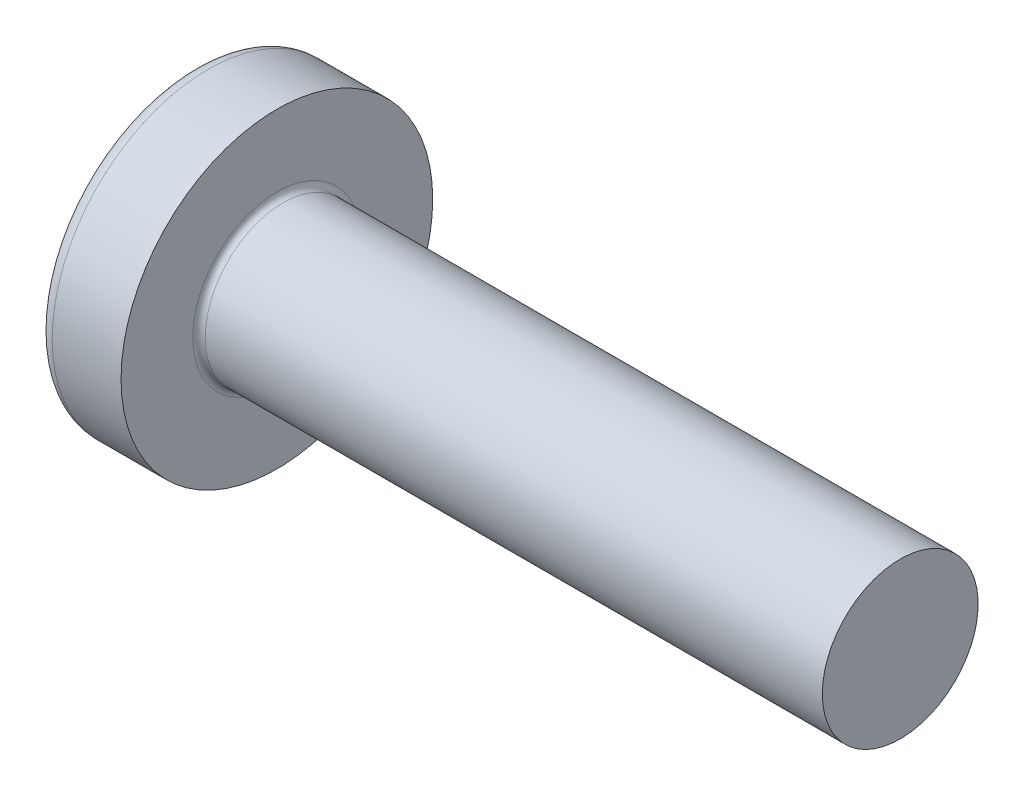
ISO-10303-21;
HEADER;
FILE_DESCRIPTION(('STEP AP214'),'2;1');
FILE_NAME('part.step','',(''),(''),'','','');
FILE_SCHEMA(('AUTOMOTIVE_DESIGN { 1 0 10303 214 1 1 1 1 }'));
ENDSEC;
DATA;
#1=APPLICATION_CONTEXT('core data for automotive mechanical design processes');
#2=APPLICATION_PROTOCOL_DEFINITION('international standard','automotive_design',2000,#1);
#3=PRODUCT_CONTEXT('',#1,'mechanical');
#4=PRODUCT('Part','Part','',(#3));
#5=PRODUCT_RELATED_PRODUCT_CATEGORY('part','',(#4));
#6=PRODUCT_DEFINITION_FORMATION('','',#4);
#7=PRODUCT_DEFINITION_CONTEXT('part definition',#1,'design');
#8=PRODUCT_DEFINITION('design','',#6,#7);
#9=PRODUCT_DEFINITION_SHAPE('','',#8);
#10=(LENGTH_UNIT() NAMED_UNIT(*) SI_UNIT(.MILLI.,.METRE.));
#11=(NAMED_UNIT(*) PLANE_ANGLE_UNIT() SI_UNIT($,.RADIAN.));
#12=(NAMED_UNIT(*) SI_UNIT($,.STERADIAN.) SOLID_ANGLE_UNIT());
#13=UNCERTAINTY_MEASURE_WITH_UNIT(LENGTH_MEASURE(1.E-05),#10,'distance_accuracy_value','');
#14=(GEOMETRIC_REPRESENTATION_CONTEXT(3) GLOBAL_UNCERTAINTY_ASSIGNED_CONTEXT((#13)) GLOBAL_UNIT_ASSIGNED_CONTEXT((#10,
#11,#12)) REPRESENTATION_CONTEXT('',''));
#15=CARTESIAN_POINT('',(0.,0.,0.));
#16=DIRECTION('',(0.,0.,1.));
#17=DIRECTION('',(1.,0.,0.));
#18=AXIS2_PLACEMENT_3D('',#15,#16,#17);
#19=CARTESIAN_POINT('',(4.,0.,0.));
#20=DIRECTION('',(-1.,0.,0.));
#21=DIRECTION('',(0.,1.,0.));
#22=AXIS2_PLACEMENT_3D('',#19,#20,#21);
#23=SPHERICAL_SURFACE('',#22,4.);
#24=CARTESIAN_POINT('',(0.803195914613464,0.,0.));
#25=DIRECTION('',(-1.,0.,0.));
#26=DIRECTION('',(0.,0.,1.));
#27=AXIS2_PLACEMENT_3D('',#24,#25,#26);
#28=CIRCLE('',#27,2.40425531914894);
#29=CARTESIAN_POINT('',(0.803195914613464,0.,2.40425531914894));
#30=VERTEX_POINT('',#29);
#31=EDGE_CURVE('E237',#30,#30,#28,.T.);
#32=ORIENTED_EDGE('',*,*,#31,.T.);
#33=EDGE_LOOP('',(#32));
#34=FACE_BOUND('',#33,.T.);
#35=CARTESIAN_POINT('',(0.0543400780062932,0.,0.));
#36=DIRECTION('',(1.,0.,0.));
#37=DIRECTION('',(0.,0.,-1.));
#38=AXIS2_PLACEMENT_3D('',#35,#36,#37);
#39=CIRCLE('',#38,0.657090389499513);
#40=CARTESIAN_POINT('',(0.0543400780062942,-0.369999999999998,-0.54301729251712));
#41=VERTEX_POINT('',#40);
#42=CARTESIAN_POINT('',(0.0543400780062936,-0.543017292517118,-0.37));
#43=VERTEX_POINT('',#42);
#44=EDGE_CURVE('E373',#41,#43,#39,.F.);
#45=ORIENTED_EDGE('',*,*,#44,.F.);
#46=CARTESIAN_POINT('',(4.,-0.37,0.));
#47=DIRECTION('',(0.,1.,0.));
#48=DIRECTION('',(0.,0.,1.));
#49=AXIS2_PLACEMENT_3D('',#46,#47,#48);
#50=CIRCLE('',#49,3.98285073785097);
#51=CARTESIAN_POINT('',(0.201999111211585,-0.369999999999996,-1.19928697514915));
#52=VERTEX_POINT('',#51);
#53=EDGE_CURVE('E299',#52,#41,#50,.T.);
#54=ORIENTED_EDGE('',*,*,#53,.F.);
#55=CARTESIAN_POINT('',(3.72274328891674,0.,0.556091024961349));
#56=DIRECTION('',(0.446197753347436,0.,-0.894934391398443));
#57=DIRECTION('',(-0.894934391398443,0.,-0.446197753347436));
#58=AXIS2_PLACEMENT_3D('',#55,#56,#57);
#59=CIRCLE('',#58,3.95144169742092);
#60=CARTESIAN_POINT('',(0.201999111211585,0.370000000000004,-1.19928697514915));
#61=VERTEX_POINT('',#60);
#62=EDGE_CURVE('E271',#52,#61,#59,.T.);
#63=ORIENTED_EDGE('',*,*,#62,.T.);
#64=CARTESIAN_POINT('',(4.,0.37,0.));
#65=DIRECTION('',(0.,-1.,0.));
#66=DIRECTION('',(0.,0.,-1.));
#67=AXIS2_PLACEMENT_3D('',#64,#65,#66);
#68=CIRCLE('',#67,3.98285073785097);
#69=CARTESIAN_POINT('',(0.0543400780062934,0.370000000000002,-0.543017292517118));
#70=VERTEX_POINT('',#69);
#71=EDGE_CURVE('E326',#70,#61,#68,.T.);
#72=ORIENTED_EDGE('',*,*,#71,.F.);
#73=CARTESIAN_POINT('',(0.0543400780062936,0.543017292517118,-0.37));
#74=VERTEX_POINT('',#73);
#75=EDGE_CURVE('E392',#74,#70,#39,.F.);
#76=ORIENTED_EDGE('',*,*,#75,.F.);
#77=CARTESIAN_POINT('',(4.,0.,-0.37));
#78=DIRECTION('',(0.,0.,1.));
#79=DIRECTION('',(1.,0.,0.));
#80=AXIS2_PLACEMENT_3D('',#77,#78,#79);
#81=CIRCLE('',#80,3.98285073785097);
#82=CARTESIAN_POINT('',(0.201999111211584,1.19928697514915,-0.37));
#83=VERTEX_POINT('',#82);
#84=EDGE_CURVE('E265',#83,#74,#81,.T.);
#85=ORIENTED_EDGE('',*,*,#84,.F.);
#86=CARTESIAN_POINT('',(3.72274328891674,-0.556091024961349,0.));
#87=DIRECTION('',(0.446197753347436,0.894934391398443,0.));
#88=DIRECTION('',(-0.894934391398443,0.446197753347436,0.));
#89=AXIS2_PLACEMENT_3D('',#86,#87,#88);
#90=CIRCLE('',#89,3.95144169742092);
#91=CARTESIAN_POINT('',(0.201999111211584,1.19928697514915,0.37));
#92=VERTEX_POINT('',#91);
#93=EDGE_CURVE('E268',#83,#92,#90,.T.);
#94=ORIENTED_EDGE('',*,*,#93,.T.);
#95=CARTESIAN_POINT('',(4.,0.,0.37));
#96=DIRECTION('',(0.,0.,-1.));
#97=DIRECTION('',(0.,1.,0.));
#98=AXIS2_PLACEMENT_3D('',#95,#96,#97);
#99=CIRCLE('',#98,3.98285073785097);
#100=CARTESIAN_POINT('',(0.0543400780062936,0.543017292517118,0.37));
#101=VERTEX_POINT('',#100);
#102=EDGE_CURVE('E261',#101,#92,#99,.T.);
#103=ORIENTED_EDGE('',*,*,#102,.F.);
#104=CARTESIAN_POINT('',(0.0543400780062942,0.369999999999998,0.54301729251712));
#105=VERTEX_POINT('',#104);
#106=EDGE_CURVE('E391',#105,#101,#39,.F.);
#107=ORIENTED_EDGE('',*,*,#106,.F.);
#108=CARTESIAN_POINT('',(0.201999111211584,0.369999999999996,1.19928697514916));
#109=VERTEX_POINT('',#108);
#110=EDGE_CURVE('E281',#109,#105,#68,.T.);
#111=ORIENTED_EDGE('',*,*,#110,.F.);
#112=CARTESIAN_POINT('',(3.72274328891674,0.,-0.556091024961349));
#113=DIRECTION('',(0.446197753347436,0.,0.894934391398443));
#114=DIRECTION('',(0.894934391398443,0.,-0.446197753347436));
#115=AXIS2_PLACEMENT_3D('',#112,#113,#114);
#116=CIRCLE('',#115,3.95144169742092);
#117=CARTESIAN_POINT('',(0.201999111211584,-0.370000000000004,1.19928697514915));
#118=VERTEX_POINT('',#117);
#119=EDGE_CURVE('E48',#109,#118,#116,.T.);
#120=ORIENTED_EDGE('',*,*,#119,.T.);
#121=CARTESIAN_POINT('',(0.0543400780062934,-0.370000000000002,0.543017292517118));
#122=VERTEX_POINT('',#121);
#123=EDGE_CURVE('E278',#122,#118,#50,.T.);
#124=ORIENTED_EDGE('',*,*,#123,.F.);
#125=CARTESIAN_POINT('',(0.0543400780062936,-0.543017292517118,0.37));
#126=VERTEX_POINT('',#125);
#127=EDGE_CURVE('E431',#126,#122,#39,.F.);
#128=ORIENTED_EDGE('',*,*,#127,.F.);
#129=CARTESIAN_POINT('',(0.201999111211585,-1.19928697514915,0.37));
#130=VERTEX_POINT('',#129);
#131=EDGE_CURVE('E262',#130,#126,#99,.T.);
#132=ORIENTED_EDGE('',*,*,#131,.F.);
#133=CARTESIAN_POINT('',(3.72274328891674,0.556091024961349,0.));
#134=DIRECTION('',(0.446197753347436,-0.894934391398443,0.));
#135=DIRECTION('',(0.894934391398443,0.446197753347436,0.));
#136=AXIS2_PLACEMENT_3D('',#133,#134,#135);
#137=CIRCLE('',#136,3.95144169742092);
#138=CARTESIAN_POINT('',(0.201999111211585,-1.19928697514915,-0.37));
#139=VERTEX_POINT('',#138);
#140=EDGE_CURVE('E258',#130,#139,#137,.T.);
#141=ORIENTED_EDGE('',*,*,#140,.T.);
#142=EDGE_CURVE('E63',#43,#139,#81,.T.);
#143=ORIENTED_EDGE('',*,*,#142,.F.);
#144=EDGE_LOOP('',(#45,#54,#63,#72,#76,#85,#94,#103,#107,#111,#120,#124,#128,#132,#141,#143));
#145=FACE_BOUND('',#144,.T.);
#146=ADVANCED_FACE('F34',(#34,#145),#23,.T.);
#147=CARTESIAN_POINT('',(1.5,0.552127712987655,-0.37));
#148=DIRECTION('',(0.,0.,1.));
#149=DIRECTION('',(1.,0.,0.));
#150=AXIS2_PLACEMENT_3D('',#147,#148,#149);
#151=PLANE('',#150);
#152=ORIENTED_EDGE('',*,*,#84,.T.);
#153=CARTESIAN_POINT('',(-0.98410748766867,0.628943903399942,-0.37));
#154=CARTESIAN_POINT('',(-0.783603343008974,0.612669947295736,-0.37));
#155=CARTESIAN_POINT('',(-0.583110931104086,0.596248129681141,-0.37));
#156=CARTESIAN_POINT('',(-0.182155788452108,0.562989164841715,-0.37));
#157=CARTESIAN_POINT('',(0.0183069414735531,0.546152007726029,-0.37));
#158=CARTESIAN_POINT('',(0.419186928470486,0.511943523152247,-0.37));
#159=CARTESIAN_POINT('',(0.61960418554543,0.4945721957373,-0.37));
#160=CARTESIAN_POINT('',(1.02037173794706,0.459102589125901,-0.37));
#161=CARTESIAN_POINT('',(1.22072203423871,0.441004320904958,-0.37));
#162=CARTESIAN_POINT('',(1.53631168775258,0.411665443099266,-0.37));
#163=CARTESIAN_POINT('',(1.65158348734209,0.400774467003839,-0.37));
#164=CARTESIAN_POINT('',(1.88208360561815,0.378547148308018,-0.37));
#165=CARTESIAN_POINT('',(1.99731192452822,0.367210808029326,-0.37));
#166=CARTESIAN_POINT('',(2.22771614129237,0.343963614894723,-0.37));
#167=CARTESIAN_POINT('',(2.34289203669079,0.332052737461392,-0.37));
#168=CARTESIAN_POINT('',(2.5731581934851,0.30741320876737,-0.37));
#169=CARTESIAN_POINT('',(2.68824845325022,0.294684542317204,-0.37));
#170=CARTESIAN_POINT('',(2.80327961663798,0.281425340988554,-0.37));
#171=B_SPLINE_CURVE_WITH_KNOTS('',3,(#153,#154,#155,#156,#157,#158,#159,#160,#161,#162,#163,
#164,#165,#166,#167,#168,#169,#170),.UNSPECIFIED.,.F.,.F.,(4,2,2,2,2,2,2,2,4),(0.,
0.603490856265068,1.20699609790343,1.81050129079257,2.41399737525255,2.7613521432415,
3.1087051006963,3.45607293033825,3.80344721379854),.UNSPECIFIED.);
#172=CARTESIAN_POINT('',(1.5,0.415013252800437,-0.370000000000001));
#173=VERTEX_POINT('',#172);
#174=EDGE_CURVE('E415',#74,#173,#171,.T.);
#175=ORIENTED_EDGE('',*,*,#174,.T.);
#176=DIRECTION('',(0.,1.,0.));
#177=VECTOR('',#176,1.);
#178=CARTESIAN_POINT('',(1.5,-0.552127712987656,-0.37));
#179=LINE('',#178,#177);
#180=CARTESIAN_POINT('',(1.5,0.552127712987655,-0.37));
#181=VERTEX_POINT('',#180);
#182=EDGE_CURVE('E355',#173,#181,#179,.T.);
#183=ORIENTED_EDGE('',*,*,#182,.T.);
#184=DIRECTION('',(0.894934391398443,-0.446197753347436,0.));
#185=VECTOR('',#184,1.);
#186=CARTESIAN_POINT('',(0.,1.3,-0.37));
#187=LINE('',#186,#185);
#188=EDGE_CURVE('E238',#83,#181,#187,.T.);
#189=ORIENTED_EDGE('',*,*,#188,.F.);
#190=EDGE_LOOP('',(#152,#175,#183,#189));
#191=FACE_BOUND('',#190,.T.);
#192=ADVANCED_FACE('F193',(#191),#151,.T.);
#193=CARTESIAN_POINT('',(1.5,-0.552127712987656,-0.37));
#194=VERTEX_POINT('',#193);
#195=CARTESIAN_POINT('',(1.5,-0.415013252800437,-0.370000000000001));
#196=VERTEX_POINT('',#195);
#197=EDGE_CURVE('E246',#194,#196,#179,.T.);
#198=ORIENTED_EDGE('',*,*,#197,.T.);
#199=CARTESIAN_POINT('',(-0.98410748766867,-0.628943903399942,-0.37));
#200=CARTESIAN_POINT('',(-0.783603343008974,-0.612669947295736,-0.37));
#201=CARTESIAN_POINT('',(-0.583110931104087,-0.596248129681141,-0.37));
#202=CARTESIAN_POINT('',(-0.182155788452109,-0.562989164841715,-0.37));
#203=CARTESIAN_POINT('',(0.0183069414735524,-0.546152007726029,-0.37));
#204=CARTESIAN_POINT('',(0.419186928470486,-0.511943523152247,-0.37));
#205=CARTESIAN_POINT('',(0.619604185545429,-0.4945721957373,-0.37));
#206=CARTESIAN_POINT('',(1.02037173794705,-0.4591025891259,-0.37));
#207=CARTESIAN_POINT('',(1.22072203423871,-0.441004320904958,-0.37));
#208=CARTESIAN_POINT('',(1.53631168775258,-0.411665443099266,-0.37));
#209=CARTESIAN_POINT('',(1.65158348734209,-0.400774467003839,-0.37));
#210=CARTESIAN_POINT('',(1.88208360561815,-0.378547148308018,-0.37));
#211=CARTESIAN_POINT('',(1.99731192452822,-0.367210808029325,-0.37));
#212=CARTESIAN_POINT('',(2.22771614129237,-0.343963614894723,-0.37));
#213=CARTESIAN_POINT('',(2.34289203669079,-0.332052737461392,-0.37));
#214=CARTESIAN_POINT('',(2.5731581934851,-0.30741320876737,-0.37));
#215=CARTESIAN_POINT('',(2.68824845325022,-0.294684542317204,-0.37));
#216=CARTESIAN_POINT('',(2.80327961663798,-0.281425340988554,-0.37));
#217=B_SPLINE_CURVE_WITH_KNOTS('',3,(#199,#200,#201,#202,#203,#204,#205,#206,#207,#208,#209,
#210,#211,#212,#213,#214,#215,#216),.UNSPECIFIED.,.F.,.F.,(4,2,2,2,2,2,2,2,4),(0.,
0.603490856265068,1.20699609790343,1.81050129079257,2.41399737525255,2.7613521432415,
3.1087051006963,3.45607293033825,3.80344721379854),.UNSPECIFIED.);
#218=EDGE_CURVE('E390',#196,#43,#217,.F.);
#219=ORIENTED_EDGE('',*,*,#218,.T.);
#220=ORIENTED_EDGE('',*,*,#142,.T.);
#221=DIRECTION('',(0.894934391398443,0.446197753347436,0.));
#222=VECTOR('',#221,1.);
#223=CARTESIAN_POINT('',(0.,-1.3,-0.37));
#224=LINE('',#223,#222);
#225=EDGE_CURVE('E329',#139,#194,#224,.T.);
#226=ORIENTED_EDGE('',*,*,#225,.T.);
#227=EDGE_LOOP('',(#198,#219,#220,#226));
#228=FACE_BOUND('',#227,.T.);
#229=ADVANCED_FACE('F199',(#228),#151,.T.);
#230=CARTESIAN_POINT('',(1.5,-0.552127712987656,0.37));
#231=DIRECTION('',(0.,0.,-1.));
#232=DIRECTION('',(0.,1.,0.));
#233=AXIS2_PLACEMENT_3D('',#230,#231,#232);
#234=PLANE('',#233);
#235=DIRECTION('',(0.,-1.,0.));
#236=VECTOR('',#235,1.);
#237=CARTESIAN_POINT('',(1.5,0.552127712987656,0.37));
#238=LINE('',#237,#236);
#239=CARTESIAN_POINT('',(1.5,0.552127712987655,0.37));
#240=VERTEX_POINT('',#239);
#241=CARTESIAN_POINT('',(1.5,0.415013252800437,0.370000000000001));
#242=VERTEX_POINT('',#241);
#243=EDGE_CURVE('E338',#240,#242,#238,.T.);
#244=ORIENTED_EDGE('',*,*,#243,.T.);
#245=CARTESIAN_POINT('',(-0.98410748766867,0.628943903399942,0.37));
#246=CARTESIAN_POINT('',(-0.783603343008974,0.612669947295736,0.37));
#247=CARTESIAN_POINT('',(-0.583110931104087,0.596248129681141,0.37));
#248=CARTESIAN_POINT('',(-0.182155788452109,0.562989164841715,0.37));
#249=CARTESIAN_POINT('',(0.0183069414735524,0.546152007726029,0.37));
#250=CARTESIAN_POINT('',(0.419186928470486,0.511943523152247,0.37));
#251=CARTESIAN_POINT('',(0.619604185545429,0.4945721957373,0.37));
#252=CARTESIAN_POINT('',(1.02037173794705,0.459102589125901,0.37));
#253=CARTESIAN_POINT('',(1.22072203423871,0.441004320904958,0.37));
#254=CARTESIAN_POINT('',(1.53631168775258,0.411665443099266,0.37));
#255=CARTESIAN_POINT('',(1.65158348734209,0.400774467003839,0.37));
#256=CARTESIAN_POINT('',(1.88208360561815,0.378547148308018,0.37));
#257=CARTESIAN_POINT('',(1.99731192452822,0.367210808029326,0.37));
#258=CARTESIAN_POINT('',(2.22771614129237,0.343963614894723,0.37));
#259=CARTESIAN_POINT('',(2.34289203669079,0.332052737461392,0.37));
#260=CARTESIAN_POINT('',(2.5731581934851,0.30741320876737,0.37));
#261=CARTESIAN_POINT('',(2.68824845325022,0.294684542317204,0.37));
#262=CARTESIAN_POINT('',(2.80327961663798,0.281425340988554,0.37));
#263=B_SPLINE_CURVE_WITH_KNOTS('',3,(#245,#246,#247,#248,#249,#250,#251,#252,#253,#254,#255,
#256,#257,#258,#259,#260,#261,#262),.UNSPECIFIED.,.F.,.F.,(4,2,2,2,2,2,2,2,4),(0.,
0.603490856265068,1.20699609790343,1.81050129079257,2.41399737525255,2.7613521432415,
3.1087051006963,3.45607293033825,3.80344721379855),.UNSPECIFIED.);
#264=EDGE_CURVE('E670',#242,#101,#263,.F.);
#265=ORIENTED_EDGE('',*,*,#264,.T.);
#266=ORIENTED_EDGE('',*,*,#102,.T.);
#267=DIRECTION('',(0.894934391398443,-0.446197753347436,0.));
#268=VECTOR('',#267,1.);
#269=CARTESIAN_POINT('',(0.,1.3,0.37));
#270=LINE('',#269,#268);
#271=EDGE_CURVE('E243',#92,#240,#270,.T.);
#272=ORIENTED_EDGE('',*,*,#271,.T.);
#273=EDGE_LOOP('',(#244,#265,#266,#272));
#274=FACE_BOUND('',#273,.T.);
#275=ADVANCED_FACE('F411',(#274),#234,.T.);
#276=ORIENTED_EDGE('',*,*,#131,.T.);
#277=CARTESIAN_POINT('',(-0.98410748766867,-0.628943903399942,0.37));
#278=CARTESIAN_POINT('',(-0.783603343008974,-0.612669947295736,0.37));
#279=CARTESIAN_POINT('',(-0.583110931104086,-0.596248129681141,0.37));
#280=CARTESIAN_POINT('',(-0.182155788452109,-0.562989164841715,0.37));
#281=CARTESIAN_POINT('',(0.0183069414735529,-0.546152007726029,0.37));
#282=CARTESIAN_POINT('',(0.419186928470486,-0.511943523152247,0.37));
#283=CARTESIAN_POINT('',(0.61960418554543,-0.4945721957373,0.37));
#284=CARTESIAN_POINT('',(1.02037173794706,-0.459102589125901,0.37));
#285=CARTESIAN_POINT('',(1.22072203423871,-0.441004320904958,0.37));
#286=CARTESIAN_POINT('',(1.53631168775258,-0.411665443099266,0.37));
#287=CARTESIAN_POINT('',(1.65158348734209,-0.400774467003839,0.37));
#288=CARTESIAN_POINT('',(1.88208360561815,-0.378547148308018,0.37));
#289=CARTESIAN_POINT('',(1.99731192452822,-0.367210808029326,0.37));
#290=CARTESIAN_POINT('',(2.22771614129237,-0.343963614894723,0.37));
#291=CARTESIAN_POINT('',(2.34289203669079,-0.332052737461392,0.37));
#292=CARTESIAN_POINT('',(2.5731581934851,-0.307413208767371,0.37));
#293=CARTESIAN_POINT('',(2.68824845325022,-0.294684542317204,0.37));
#294=CARTESIAN_POINT('',(2.80327961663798,-0.281425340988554,0.37));
#295=B_SPLINE_CURVE_WITH_KNOTS('',3,(#277,#278,#279,#280,#281,#282,#283,#284,#285,#286,#287,
#288,#289,#290,#291,#292,#293,#294),.UNSPECIFIED.,.F.,.F.,(4,2,2,2,2,2,2,2,4),(0.,
0.603490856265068,1.20699609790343,1.81050129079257,2.41399737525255,2.7613521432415,
3.1087051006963,3.45607293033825,3.80344721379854),.UNSPECIFIED.);
#296=CARTESIAN_POINT('',(1.5,-0.415013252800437,0.370000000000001));
#297=VERTEX_POINT('',#296);
#298=EDGE_CURVE('E432',#126,#297,#295,.T.);
#299=ORIENTED_EDGE('',*,*,#298,.T.);
#300=CARTESIAN_POINT('',(1.5,-0.552127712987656,0.37));
#301=VERTEX_POINT('',#300);
#302=EDGE_CURVE('E340',#297,#301,#238,.T.);
#303=ORIENTED_EDGE('',*,*,#302,.T.);
#304=DIRECTION('',(0.894934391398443,0.446197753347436,0.));
#305=VECTOR('',#304,1.);
#306=CARTESIAN_POINT('',(0.,-1.3,0.37));
#307=LINE('',#306,#305);
#308=EDGE_CURVE('E331',#130,#301,#307,.T.);
#309=ORIENTED_EDGE('',*,*,#308,.F.);
#310=EDGE_LOOP('',(#276,#299,#303,#309));
#311=FACE_BOUND('',#310,.T.);
#312=ADVANCED_FACE('F518',(#311),#234,.T.);
#313=CARTESIAN_POINT('',(1.5,0.552127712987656,0.37));
#314=DIRECTION('',(0.446197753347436,0.894934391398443,0.));
#315=DIRECTION('',(-0.894934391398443,0.446197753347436,0.));
#316=AXIS2_PLACEMENT_3D('',#313,#314,#315);
#317=PLANE('',#316);
#318=CARTESIAN_POINT('',(2.47007552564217,0.0684659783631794,0.));
#319=DIRECTION('',(0.446197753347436,0.894934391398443,0.));
#320=DIRECTION('',(-0.894934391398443,0.446197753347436,0.));
#321=AXIS2_PLACEMENT_3D('',#318,#319,#320);
#322=ELLIPSE('',#321,1.0940568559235,0.483340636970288);
#323=CARTESIAN_POINT('',(1.5,0.552127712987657,0.0655056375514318));
#324=VERTEX_POINT('',#323);
#325=CARTESIAN_POINT('',(1.5,0.552127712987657,-0.0655056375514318));
#326=VERTEX_POINT('',#325);
#327=EDGE_CURVE('E304',#324,#326,#322,.F.);
#328=ORIENTED_EDGE('',*,*,#327,.F.);
#329=DIRECTION('',(0.,0.,-1.));
#330=VECTOR('',#329,1.);
#331=CARTESIAN_POINT('',(1.5,0.552127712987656,0.37));
#332=LINE('',#331,#330);
#333=EDGE_CURVE('E341',#240,#324,#332,.T.);
#334=ORIENTED_EDGE('',*,*,#333,.F.);
#335=ORIENTED_EDGE('',*,*,#271,.F.);
#336=ORIENTED_EDGE('',*,*,#93,.F.);
#337=ORIENTED_EDGE('',*,*,#188,.T.);
#338=EDGE_CURVE('E343',#326,#181,#332,.T.);
#339=ORIENTED_EDGE('',*,*,#338,.F.);
#340=EDGE_LOOP('',(#328,#334,#335,#336,#337,#339));
#341=FACE_BOUND('',#340,.T.);
#342=ADVANCED_FACE('F409',(#341),#317,.F.);
#343=CARTESIAN_POINT('',(0.,-1.3,-0.37));
#344=DIRECTION('',(0.446197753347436,-0.894934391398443,0.));
#345=DIRECTION('',(0.894934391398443,0.446197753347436,0.));
#346=AXIS2_PLACEMENT_3D('',#343,#344,#345);
#347=PLANE('',#346);
#348=CARTESIAN_POINT('',(2.47007552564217,-0.0684659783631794,0.));
#349=DIRECTION('',(0.446197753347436,-0.894934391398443,0.));
#350=DIRECTION('',(-0.894934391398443,-0.446197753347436,0.));
#351=AXIS2_PLACEMENT_3D('',#348,#349,#350);
#352=ELLIPSE('',#351,1.0940568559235,0.483340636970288);
#353=CARTESIAN_POINT('',(1.5,-0.552127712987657,-0.0655056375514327));
#354=VERTEX_POINT('',#353);
#355=CARTESIAN_POINT('',(1.5,-0.552127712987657,0.0655056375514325));
#356=VERTEX_POINT('',#355);
#357=EDGE_CURVE('E672',#354,#356,#352,.F.);
#358=ORIENTED_EDGE('',*,*,#357,.F.);
#359=DIRECTION('',(0.,0.,1.));
#360=VECTOR('',#359,1.);
#361=CARTESIAN_POINT('',(1.5,-0.552127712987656,-0.37));
#362=LINE('',#361,#360);
#363=EDGE_CURVE('E334',#194,#354,#362,.T.);
#364=ORIENTED_EDGE('',*,*,#363,.F.);
#365=ORIENTED_EDGE('',*,*,#225,.F.);
#366=ORIENTED_EDGE('',*,*,#140,.F.);
#367=ORIENTED_EDGE('',*,*,#308,.T.);
#368=EDGE_CURVE('E337',#356,#301,#362,.T.);
#369=ORIENTED_EDGE('',*,*,#368,.F.);
#370=EDGE_LOOP('',(#358,#364,#365,#366,#367,#369));
#371=FACE_BOUND('',#370,.T.);
#372=ADVANCED_FACE('F505',(#371),#347,.F.);
#373=CARTESIAN_POINT('',(1.5,0.552127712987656,-0.37));
#374=DIRECTION('',(-1.,0.,0.));
#375=DIRECTION('',(0.,0.,1.));
#376=AXIS2_PLACEMENT_3D('',#373,#374,#375);
#377=PLANE('',#376);
#378=DIRECTION('',(0.,1.,0.));
#379=VECTOR('',#378,1.);
#380=CARTESIAN_POINT('',(1.5,-0.370000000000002,0.552127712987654));
#381=LINE('',#380,#379);
#382=CARTESIAN_POINT('',(1.5,-0.370000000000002,0.552127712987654));
#383=VERTEX_POINT('',#382);
#384=CARTESIAN_POINT('',(1.5,-0.0655056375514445,0.552127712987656));
#385=VERTEX_POINT('',#384);
#386=EDGE_CURVE('E319',#383,#385,#381,.T.);
#387=ORIENTED_EDGE('',*,*,#386,.T.);
#388=CARTESIAN_POINT('',(1.5,0.,0.));
#389=DIRECTION('',(-1.,0.,0.));
#390=DIRECTION('',(0.,0.,1.));
#391=AXIS2_PLACEMENT_3D('',#388,#389,#390);
#392=CIRCLE('',#391,0.556);
#393=CARTESIAN_POINT('',(1.5,-0.370000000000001,0.415013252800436));
#394=VERTEX_POINT('',#393);
#395=EDGE_CURVE('E700',#394,#385,#392,.T.);
#396=ORIENTED_EDGE('',*,*,#395,.F.);
#397=DIRECTION('',(0.,0.,-1.));
#398=VECTOR('',#397,1.);
#399=CARTESIAN_POINT('',(1.5,-0.370000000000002,0.552127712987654));
#400=LINE('',#399,#398);
#401=EDGE_CURVE('E315',#383,#394,#400,.T.);
#402=ORIENTED_EDGE('',*,*,#401,.F.);
#403=EDGE_LOOP('',(#387,#396,#402));
#404=FACE_BOUND('',#403,.T.);
#405=ADVANCED_FACE('F498',(#404),#377,.T.);
#406=ORIENTED_EDGE('',*,*,#302,.F.);
#407=EDGE_CURVE('E705',#356,#297,#392,.T.);
#408=ORIENTED_EDGE('',*,*,#407,.F.);
#409=ORIENTED_EDGE('',*,*,#368,.T.);
#410=EDGE_LOOP('',(#406,#408,#409));
#411=FACE_BOUND('',#410,.T.);
#412=ADVANCED_FACE('F491',(#411),#377,.T.);
#413=ORIENTED_EDGE('',*,*,#363,.T.);
#414=EDGE_CURVE('E384',#196,#354,#392,.T.);
#415=ORIENTED_EDGE('',*,*,#414,.F.);
#416=ORIENTED_EDGE('',*,*,#197,.F.);
#417=EDGE_LOOP('',(#413,#415,#416));
#418=FACE_BOUND('',#417,.T.);
#419=ADVANCED_FACE('F485',(#418),#377,.T.);
#420=CARTESIAN_POINT('',(1.5,-0.369999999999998,-0.415013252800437));
#421=VERTEX_POINT('',#420);
#422=CARTESIAN_POINT('',(1.5,-0.369999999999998,-0.552127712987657));
#423=VERTEX_POINT('',#422);
#424=EDGE_CURVE('E318',#421,#423,#400,.T.);
#425=ORIENTED_EDGE('',*,*,#424,.F.);
#426=CARTESIAN_POINT('',(1.5,-0.0655056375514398,-0.552127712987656));
#427=VERTEX_POINT('',#426);
#428=EDGE_CURVE('E55',#427,#421,#392,.T.);
#429=ORIENTED_EDGE('',*,*,#428,.F.);
#430=DIRECTION('',(0.,-1.,0.));
#431=VECTOR('',#430,1.);
#432=CARTESIAN_POINT('',(1.5,0.370000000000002,-0.552127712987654));
#433=LINE('',#432,#431);
#434=EDGE_CURVE('E314',#427,#423,#433,.T.);
#435=ORIENTED_EDGE('',*,*,#434,.T.);
#436=EDGE_LOOP('',(#425,#429,#435));
#437=FACE_BOUND('',#436,.T.);
#438=ADVANCED_FACE('F379',(#437),#377,.T.);
#439=CARTESIAN_POINT('',(1.5,0.370000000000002,-0.552127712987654));
#440=VERTEX_POINT('',#439);
#441=CARTESIAN_POINT('',(1.5,0.0655056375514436,-0.552127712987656));
#442=VERTEX_POINT('',#441);
#443=EDGE_CURVE('E311',#440,#442,#433,.T.);
#444=ORIENTED_EDGE('',*,*,#443,.T.);
#445=CARTESIAN_POINT('',(1.5,0.370000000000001,-0.415013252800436));
#446=VERTEX_POINT('',#445);
#447=EDGE_CURVE('E383',#446,#442,#392,.T.);
#448=ORIENTED_EDGE('',*,*,#447,.F.);
#449=DIRECTION('',(0.,0.,1.));
#450=VECTOR('',#449,1.);
#451=CARTESIAN_POINT('',(1.5,0.370000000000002,-0.552127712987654));
#452=LINE('',#451,#450);
#453=EDGE_CURVE('E323',#440,#446,#452,.T.);
#454=ORIENTED_EDGE('',*,*,#453,.F.);
#455=EDGE_LOOP('',(#444,#448,#454));
#456=FACE_BOUND('',#455,.T.);
#457=ADVANCED_FACE('F473',(#456),#377,.T.);
#458=ORIENTED_EDGE('',*,*,#182,.F.);
#459=EDGE_CURVE('E689',#326,#173,#392,.T.);
#460=ORIENTED_EDGE('',*,*,#459,.F.);
#461=ORIENTED_EDGE('',*,*,#338,.T.);
#462=EDGE_LOOP('',(#458,#460,#461));
#463=FACE_BOUND('',#462,.T.);
#464=ADVANCED_FACE('F466',(#463),#377,.T.);
#465=ORIENTED_EDGE('',*,*,#333,.T.);
#466=EDGE_CURVE('E691',#242,#324,#392,.T.);
#467=ORIENTED_EDGE('',*,*,#466,.F.);
#468=ORIENTED_EDGE('',*,*,#243,.F.);
#469=EDGE_LOOP('',(#465,#467,#468));
#470=FACE_BOUND('',#469,.T.);
#471=ADVANCED_FACE('F460',(#470),#377,.T.);
#472=CARTESIAN_POINT('',(1.5,0.369999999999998,0.552127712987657));
#473=DIRECTION('',(0.,-1.,0.));
#474=DIRECTION('',(1.,0.,0.));
#475=AXIS2_PLACEMENT_3D('',#472,#473,#474);
#476=PLANE('',#475);
#477=ORIENTED_EDGE('',*,*,#110,.T.);
#478=CARTESIAN_POINT('',(-0.98410748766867,0.369999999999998,0.628943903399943));
#479=CARTESIAN_POINT('',(-0.783603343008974,0.369999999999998,0.612669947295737));
#480=CARTESIAN_POINT('',(-0.583110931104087,0.369999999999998,0.596248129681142));
#481=CARTESIAN_POINT('',(-0.182155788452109,0.369999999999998,0.562989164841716));
#482=CARTESIAN_POINT('',(0.0183069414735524,0.369999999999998,0.546152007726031));
#483=CARTESIAN_POINT('',(0.419186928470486,0.369999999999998,0.511943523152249));
#484=CARTESIAN_POINT('',(0.619604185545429,0.369999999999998,0.494572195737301));
#485=CARTESIAN_POINT('',(1.02037173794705,0.369999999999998,0.459102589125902));
#486=CARTESIAN_POINT('',(1.22072203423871,0.369999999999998,0.44100432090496));
#487=CARTESIAN_POINT('',(1.53631168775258,0.369999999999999,0.411665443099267));
#488=CARTESIAN_POINT('',(1.65158348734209,0.369999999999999,0.40077446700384));
#489=CARTESIAN_POINT('',(1.88208360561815,0.369999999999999,0.37854714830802));
#490=CARTESIAN_POINT('',(1.99731192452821,0.369999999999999,0.367210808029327));
#491=CARTESIAN_POINT('',(2.22771614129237,0.369999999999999,0.343963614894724));
#492=CARTESIAN_POINT('',(2.34289203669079,0.369999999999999,0.332052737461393));
#493=CARTESIAN_POINT('',(2.5731581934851,0.369999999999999,0.307413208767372));
#494=CARTESIAN_POINT('',(2.68824845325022,0.369999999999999,0.294684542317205));
#495=CARTESIAN_POINT('',(2.80327961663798,0.369999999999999,0.281425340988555));
#496=B_SPLINE_CURVE_WITH_KNOTS('',3,(#478,#479,#480,#481,#482,#483,#484,#485,#486,#487,#488,
#489,#490,#491,#492,#493,#494,#495),.UNSPECIFIED.,.F.,.F.,(4,2,2,2,2,2,2,2,4),(0.,
0.603490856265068,1.20699609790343,1.81050129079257,2.41399737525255,2.7613521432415,
3.1087051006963,3.45607293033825,3.80344721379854),.UNSPECIFIED.);
#497=CARTESIAN_POINT('',(1.5,0.369999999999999,0.415013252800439));
#498=VERTEX_POINT('',#497);
#499=EDGE_CURVE('E669',#105,#498,#496,.T.);
#500=ORIENTED_EDGE('',*,*,#499,.T.);
#501=CARTESIAN_POINT('',(1.5,0.369999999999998,0.552127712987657));
#502=VERTEX_POINT('',#501);
#503=EDGE_CURVE('E296',#498,#502,#452,.T.);
#504=ORIENTED_EDGE('',*,*,#503,.T.);
#505=DIRECTION('',(0.894934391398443,0.,-0.446197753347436));
#506=VECTOR('',#505,1.);
#507=CARTESIAN_POINT('',(0.,0.369999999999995,1.3));
#508=LINE('',#507,#506);
#509=EDGE_CURVE('E289',#109,#502,#508,.T.);
#510=ORIENTED_EDGE('',*,*,#509,.F.);
#511=EDGE_LOOP('',(#477,#500,#504,#510));
#512=FACE_BOUND('',#511,.T.);
#513=ADVANCED_FACE('F293',(#512),#476,.T.);
#514=CARTESIAN_POINT('',(1.5,-0.369999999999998,-0.552127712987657));
#515=DIRECTION('',(0.,1.,0.));
#516=DIRECTION('',(0.,0.,1.));
#517=AXIS2_PLACEMENT_3D('',#514,#515,#516);
#518=PLANE('',#517);
#519=ORIENTED_EDGE('',*,*,#401,.T.);
#520=CARTESIAN_POINT('',(-0.98410748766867,-0.370000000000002,0.62894390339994));
#521=CARTESIAN_POINT('',(-0.783603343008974,-0.370000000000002,0.612669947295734));
#522=CARTESIAN_POINT('',(-0.583110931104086,-0.370000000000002,0.59624812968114));
#523=CARTESIAN_POINT('',(-0.182155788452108,-0.370000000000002,0.562989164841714));
#524=CARTESIAN_POINT('',(0.0183069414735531,-0.370000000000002,0.546152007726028));
#525=CARTESIAN_POINT('',(0.419186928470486,-0.370000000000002,0.511943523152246));
#526=CARTESIAN_POINT('',(0.61960418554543,-0.370000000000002,0.494572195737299));
#527=CARTESIAN_POINT('',(1.02037173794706,-0.370000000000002,0.459102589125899));
#528=CARTESIAN_POINT('',(1.22072203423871,-0.370000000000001,0.441004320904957));
#529=CARTESIAN_POINT('',(1.53631168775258,-0.370000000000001,0.411665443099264));
#530=CARTESIAN_POINT('',(1.65158348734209,-0.370000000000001,0.400774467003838));
#531=CARTESIAN_POINT('',(1.88208360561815,-0.370000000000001,0.378547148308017));
#532=CARTESIAN_POINT('',(1.99731192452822,-0.370000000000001,0.367210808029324));
#533=CARTESIAN_POINT('',(2.22771614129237,-0.370000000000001,0.343963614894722));
#534=CARTESIAN_POINT('',(2.34289203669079,-0.370000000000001,0.33205273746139));
#535=CARTESIAN_POINT('',(2.5731581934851,-0.370000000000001,0.307413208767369));
#536=CARTESIAN_POINT('',(2.68824845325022,-0.370000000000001,0.294684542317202));
#537=CARTESIAN_POINT('',(2.80327961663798,-0.370000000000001,0.281425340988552));
#538=B_SPLINE_CURVE_WITH_KNOTS('',3,(#520,#521,#522,#523,#524,#525,#526,#527,#528,#529,#530,
#531,#532,#533,#534,#535,#536,#537),.UNSPECIFIED.,.F.,.F.,(4,2,2,2,2,2,2,2,4),(0.,
0.603490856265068,1.20699609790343,1.81050129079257,2.41399737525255,2.7613521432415,
3.1087051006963,3.45607293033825,3.80344721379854),.UNSPECIFIED.);
#539=EDGE_CURVE('E424',#394,#122,#538,.F.);
#540=ORIENTED_EDGE('',*,*,#539,.T.);
#541=ORIENTED_EDGE('',*,*,#123,.T.);
#542=DIRECTION('',(0.894934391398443,0.,-0.446197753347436));
#543=VECTOR('',#542,1.);
#544=CARTESIAN_POINT('',(0.,-0.370000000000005,1.3));
#545=LINE('',#544,#543);
#546=EDGE_CURVE('E291',#118,#383,#545,.T.);
#547=ORIENTED_EDGE('',*,*,#546,.T.);
#548=EDGE_LOOP('',(#519,#540,#541,#547));
#549=FACE_BOUND('',#548,.T.);
#550=ADVANCED_FACE('F228',(#549),#518,.T.);
#551=CARTESIAN_POINT('',(1.5,-0.370000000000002,0.552127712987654));
#552=DIRECTION('',(0.446197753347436,0.,0.894934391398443));
#553=DIRECTION('',(-0.894934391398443,0.,0.446197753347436));
#554=AXIS2_PLACEMENT_3D('',#551,#552,#553);
#555=PLANE('',#554);
#556=CARTESIAN_POINT('',(2.47007552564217,0.,0.0684659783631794));
#557=DIRECTION('',(0.446197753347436,0.,0.894934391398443));
#558=DIRECTION('',(-0.894934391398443,0.,0.446197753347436));
#559=AXIS2_PLACEMENT_3D('',#556,#557,#558);
#560=ELLIPSE('',#559,1.0940568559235,0.483340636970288);
#561=CARTESIAN_POINT('',(1.5,0.0655056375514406,0.552127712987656));
#562=VERTEX_POINT('',#561);
#563=EDGE_CURVE('E422',#385,#562,#560,.F.);
#564=ORIENTED_EDGE('',*,*,#563,.F.);
#565=ORIENTED_EDGE('',*,*,#386,.F.);
#566=ORIENTED_EDGE('',*,*,#546,.F.);
#567=ORIENTED_EDGE('',*,*,#119,.F.);
#568=ORIENTED_EDGE('',*,*,#509,.T.);
#569=EDGE_CURVE('E322',#562,#502,#381,.T.);
#570=ORIENTED_EDGE('',*,*,#569,.F.);
#571=EDGE_LOOP('',(#564,#565,#566,#567,#568,#570));
#572=FACE_BOUND('',#571,.T.);
#573=ADVANCED_FACE('F287',(#572),#555,.F.);
#574=CARTESIAN_POINT('',(0.,0.370000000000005,-1.3));
#575=DIRECTION('',(0.446197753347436,0.,-0.894934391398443));
#576=DIRECTION('',(0.894934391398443,0.,0.446197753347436));
#577=AXIS2_PLACEMENT_3D('',#574,#575,#576);
#578=PLANE('',#577);
#579=CARTESIAN_POINT('',(2.47007552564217,0.,-0.0684659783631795));
#580=DIRECTION('',(0.446197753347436,0.,-0.894934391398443));
#581=DIRECTION('',(-0.894934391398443,0.,-0.446197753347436));
#582=AXIS2_PLACEMENT_3D('',#579,#580,#581);
#583=ELLIPSE('',#582,1.0940568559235,0.483340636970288);
#584=EDGE_CURVE('E377',#442,#427,#583,.F.);
#585=ORIENTED_EDGE('',*,*,#584,.F.);
#586=ORIENTED_EDGE('',*,*,#443,.F.);
#587=DIRECTION('',(0.894934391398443,0.,0.446197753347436));
#588=VECTOR('',#587,1.);
#589=CARTESIAN_POINT('',(0.,0.370000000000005,-1.3));
#590=LINE('',#589,#588);
#591=EDGE_CURVE('E301',#61,#440,#590,.T.);
#592=ORIENTED_EDGE('',*,*,#591,.F.);
#593=ORIENTED_EDGE('',*,*,#62,.F.);
#594=DIRECTION('',(0.894934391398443,0.,0.446197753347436));
#595=VECTOR('',#594,1.);
#596=CARTESIAN_POINT('',(0.,-0.369999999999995,-1.3));
#597=LINE('',#596,#595);
#598=EDGE_CURVE('E308',#52,#423,#597,.T.);
#599=ORIENTED_EDGE('',*,*,#598,.T.);
#600=ORIENTED_EDGE('',*,*,#434,.F.);
#601=EDGE_LOOP('',(#585,#586,#592,#593,#599,#600));
#602=FACE_BOUND('',#601,.T.);
#603=ADVANCED_FACE('F368',(#602),#578,.F.);
#604=ORIENTED_EDGE('',*,*,#453,.T.);
#605=CARTESIAN_POINT('',(-0.984107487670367,0.370000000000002,-0.628943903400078));
#606=CARTESIAN_POINT('',(-0.783603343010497,0.370000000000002,-0.612669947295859));
#607=CARTESIAN_POINT('',(-0.583110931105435,0.370000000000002,-0.596248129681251));
#608=CARTESIAN_POINT('',(-0.182155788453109,0.370000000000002,-0.562989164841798));
#609=CARTESIAN_POINT('',(0.0183069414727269,0.370000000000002,-0.546152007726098));
#610=CARTESIAN_POINT('',(0.419186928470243,0.370000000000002,-0.511943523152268));
#611=CARTESIAN_POINT('',(0.619604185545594,0.370000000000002,-0.494572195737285));
#612=CARTESIAN_POINT('',(1.02037173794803,0.370000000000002,-0.459102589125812));
#613=CARTESIAN_POINT('',(1.2207220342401,0.370000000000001,-0.441004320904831));
#614=CARTESIAN_POINT('',(1.53631168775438,0.370000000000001,-0.411665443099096));
#615=CARTESIAN_POINT('',(1.65158348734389,0.370000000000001,-0.400774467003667));
#616=CARTESIAN_POINT('',(1.88208360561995,0.370000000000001,-0.378547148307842));
#617=CARTESIAN_POINT('',(1.99731192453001,0.370000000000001,-0.367210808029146));
#618=CARTESIAN_POINT('',(2.22771614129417,0.370000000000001,-0.343963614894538));
#619=CARTESIAN_POINT('',(2.34289203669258,0.370000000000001,-0.332052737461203));
#620=CARTESIAN_POINT('',(2.57315819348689,0.370000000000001,-0.307413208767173));
#621=CARTESIAN_POINT('',(2.68824845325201,0.370000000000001,-0.294684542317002));
#622=CARTESIAN_POINT('',(2.80327961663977,0.370000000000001,-0.281425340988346));
#623=B_SPLINE_CURVE_WITH_KNOTS('',3,(#605,#606,#607,#608,#609,#610,#611,#612,#613,#614,#615,
#616,#617,#618,#619,#620,#621,#622),.UNSPECIFIED.,.F.,.F.,(4,2,2,2,2,2,2,2,4),(0.,
0.603490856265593,1.20699609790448,1.81050129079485,2.41399737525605,2.76135214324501,
3.1087051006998,3.45607293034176,3.80344721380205),.UNSPECIFIED.);
#624=EDGE_CURVE('E364',#446,#70,#623,.F.);
#625=ORIENTED_EDGE('',*,*,#624,.T.);
#626=ORIENTED_EDGE('',*,*,#71,.T.);
#627=ORIENTED_EDGE('',*,*,#591,.T.);
#628=EDGE_LOOP('',(#604,#625,#626,#627));
#629=FACE_BOUND('',#628,.T.);
#630=ADVANCED_FACE('F226',(#629),#476,.T.);
#631=ORIENTED_EDGE('',*,*,#53,.T.);
#632=CARTESIAN_POINT('',(-0.984107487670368,-0.369999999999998,-0.628943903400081));
#633=CARTESIAN_POINT('',(-0.783603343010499,-0.369999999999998,-0.612669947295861));
#634=CARTESIAN_POINT('',(-0.583110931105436,-0.369999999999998,-0.596248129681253));
#635=CARTESIAN_POINT('',(-0.18215578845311,-0.369999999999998,-0.5629891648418));
#636=CARTESIAN_POINT('',(0.0183069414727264,-0.369999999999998,-0.546152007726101));
#637=CARTESIAN_POINT('',(0.419186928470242,-0.369999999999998,-0.51194352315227));
#638=CARTESIAN_POINT('',(0.619604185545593,-0.369999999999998,-0.494572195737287));
#639=CARTESIAN_POINT('',(1.02037173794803,-0.369999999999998,-0.459102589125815));
#640=CARTESIAN_POINT('',(1.22072203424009,-0.369999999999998,-0.441004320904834));
#641=CARTESIAN_POINT('',(1.53631168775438,-0.369999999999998,-0.411665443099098));
#642=CARTESIAN_POINT('',(1.65158348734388,-0.369999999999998,-0.40077446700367));
#643=CARTESIAN_POINT('',(1.88208360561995,-0.369999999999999,-0.378547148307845));
#644=CARTESIAN_POINT('',(1.99731192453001,-0.369999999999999,-0.367210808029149));
#645=CARTESIAN_POINT('',(2.22771614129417,-0.369999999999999,-0.343963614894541));
#646=CARTESIAN_POINT('',(2.34289203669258,-0.369999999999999,-0.332052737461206));
#647=CARTESIAN_POINT('',(2.57315819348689,-0.369999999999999,-0.307413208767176));
#648=CARTESIAN_POINT('',(2.68824845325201,-0.369999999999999,-0.294684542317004));
#649=CARTESIAN_POINT('',(2.80327961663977,-0.369999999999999,-0.281425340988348));
#650=B_SPLINE_CURVE_WITH_KNOTS('',3,(#632,#633,#634,#635,#636,#637,#638,#639,#640,#641,#642,
#643,#644,#645,#646,#647,#648,#649),.UNSPECIFIED.,.F.,.F.,(4,2,2,2,2,2,2,2,4),(0.,
0.603490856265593,1.20699609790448,1.81050129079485,2.41399737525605,2.76135214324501,
3.1087051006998,3.45607293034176,3.80344721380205),.UNSPECIFIED.);
#651=EDGE_CURVE('E11',#41,#421,#650,.T.);
#652=ORIENTED_EDGE('',*,*,#651,.T.);
#653=ORIENTED_EDGE('',*,*,#424,.T.);
#654=ORIENTED_EDGE('',*,*,#598,.F.);
#655=EDGE_LOOP('',(#631,#652,#653,#654));
#656=FACE_BOUND('',#655,.T.);
#657=ADVANCED_FACE('F221',(#656),#518,.T.);
#658=CARTESIAN_POINT('',(-25.4,0.,0.));
#659=DIRECTION('',(-1.,0.,0.));
#660=DIRECTION('',(0.,0.,1.));
#661=AXIS2_PLACEMENT_3D('',#658,#659,#660);
#662=CYLINDRICAL_SURFACE('',#661,1.25);
#663=CARTESIAN_POINT('',(2.2,0.,0.));
#664=DIRECTION('',(-1.,0.,0.));
#665=DIRECTION('',(0.,0.,1.));
#666=AXIS2_PLACEMENT_3D('',#663,#664,#665);
#667=CIRCLE('',#666,1.25);
#668=CARTESIAN_POINT('',(2.2,0.,1.25));
#669=VERTEX_POINT('',#668);
#670=EDGE_CURVE('E232',#669,#669,#667,.F.);
#671=ORIENTED_EDGE('',*,*,#670,.T.);
#672=EDGE_LOOP('',(#671));
#673=FACE_BOUND('',#672,.T.);
#674=CARTESIAN_POINT('',(12.1,0.,0.));
#675=DIRECTION('',(-1.,0.,0.));
#676=DIRECTION('',(0.,0.,1.));
#677=AXIS2_PLACEMENT_3D('',#674,#675,#676);
#678=CIRCLE('',#677,1.25);
#679=CARTESIAN_POINT('',(12.1,0.,1.25));
#680=VERTEX_POINT('',#679);
#681=EDGE_CURVE('E235',#680,#680,#678,.T.);
#682=ORIENTED_EDGE('',*,*,#681,.T.);
#683=EDGE_LOOP('',(#682));
#684=FACE_BOUND('',#683,.T.);
#685=ADVANCED_FACE('F218',(#673,#684),#662,.T.);
#686=CARTESIAN_POINT('',(2.1,1.25,0.));
#687=DIRECTION('',(-1.,0.,0.));
#688=DIRECTION('',(0.,0.,1.));
#689=AXIS2_PLACEMENT_3D('',#686,#687,#688);
#690=PLANE('',#689);
#691=CARTESIAN_POINT('',(2.1,0.,0.));
#692=DIRECTION('',(-1.,0.,0.));
#693=DIRECTION('',(0.,0.,1.));
#694=AXIS2_PLACEMENT_3D('',#691,#692,#693);
#695=CIRCLE('',#694,1.35);
#696=CARTESIAN_POINT('',(2.1,0.,1.35));
#697=VERTEX_POINT('',#696);
#698=EDGE_CURVE('E254',#697,#697,#695,.T.);
#699=ORIENTED_EDGE('',*,*,#698,.T.);
#700=EDGE_LOOP('',(#699));
#701=FACE_BOUND('',#700,.T.);
#702=CARTESIAN_POINT('',(2.1,0.,0.));
#703=DIRECTION('',(-1.,0.,0.));
#704=DIRECTION('',(0.,0.,1.));
#705=AXIS2_PLACEMENT_3D('',#702,#703,#704);
#706=CIRCLE('',#705,2.5);
#707=CARTESIAN_POINT('',(2.1,0.,2.5));
#708=VERTEX_POINT('',#707);
#709=EDGE_CURVE('E251',#708,#708,#706,.T.);
#710=ORIENTED_EDGE('',*,*,#709,.F.);
#711=EDGE_LOOP('',(#710));
#712=FACE_BOUND('',#711,.T.);
#713=ADVANCED_FACE('F215',(#701,#712),#690,.F.);
#714=CARTESIAN_POINT('',(-25.4,0.,0.));
#715=DIRECTION('',(-1.,0.,0.));
#716=DIRECTION('',(0.,0.,1.));
#717=AXIS2_PLACEMENT_3D('',#714,#715,#716);
#718=CYLINDRICAL_SURFACE('',#717,2.5);
#719=ORIENTED_EDGE('',*,*,#709,.T.);
#720=EDGE_LOOP('',(#719));
#721=FACE_BOUND('',#720,.T.);
#722=CARTESIAN_POINT('',(0.995004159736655,0.,0.));
#723=DIRECTION('',(-1.,0.,0.));
#724=DIRECTION('',(0.,0.,1.));
#725=AXIS2_PLACEMENT_3D('',#722,#723,#724);
#726=CIRCLE('',#725,2.5);
#727=CARTESIAN_POINT('',(0.995004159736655,0.,2.5));
#728=VERTEX_POINT('',#727);
#729=EDGE_CURVE('E240',#728,#728,#726,.T.);
#730=ORIENTED_EDGE('',*,*,#729,.F.);
#731=EDGE_LOOP('',(#730));
#732=FACE_BOUND('',#731,.T.);
#733=ADVANCED_FACE('F211',(#721,#732),#718,.T.);
#734=CARTESIAN_POINT('',(0.995004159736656,0.,0.));
#735=DIRECTION('',(-1.,0.,0.));
#736=DIRECTION('',(0.,0.,1.));
#737=AXIS2_PLACEMENT_3D('',#734,#735,#736);
#738=TOROIDAL_SURFACE('',#737,2.26,0.24);
#739=ORIENTED_EDGE('',*,*,#729,.T.);
#740=EDGE_LOOP('',(#739));
#741=FACE_BOUND('',#740,.T.);
#742=ORIENTED_EDGE('',*,*,#31,.F.);
#743=EDGE_LOOP('',(#742));
#744=FACE_BOUND('',#743,.T.);
#745=ADVANCED_FACE('F208',(#741,#744),#738,.T.);
#746=CARTESIAN_POINT('',(12.1,1.25,0.));
#747=DIRECTION('',(1.,0.,0.));
#748=DIRECTION('',(0.,0.,-1.));
#749=AXIS2_PLACEMENT_3D('',#746,#747,#748);
#750=PLANE('',#749);
#751=ORIENTED_EDGE('',*,*,#681,.F.);
#752=EDGE_LOOP('',(#751));
#753=FACE_BOUND('',#752,.T.);
#754=ADVANCED_FACE('F206',(#753),#750,.T.);
#755=CARTESIAN_POINT('',(2.2,0.,0.));
#756=DIRECTION('',(-1.,0.,0.));
#757=DIRECTION('',(0.,0.,1.));
#758=AXIS2_PLACEMENT_3D('',#755,#756,#757);
#759=TOROIDAL_SURFACE('',#758,1.35,0.1);
#760=ORIENTED_EDGE('',*,*,#670,.F.);
#761=EDGE_LOOP('',(#760));
#762=FACE_BOUND('',#761,.T.);
#763=ORIENTED_EDGE('',*,*,#698,.F.);
#764=EDGE_LOOP('',(#763));
#765=FACE_BOUND('',#764,.T.);
#766=ADVANCED_FACE('F36',(#762,#765),#759,.F.);
#767=ORIENTED_EDGE('',*,*,#503,.F.);
#768=EDGE_CURVE('E385',#562,#498,#392,.T.);
#769=ORIENTED_EDGE('',*,*,#768,.F.);
#770=ORIENTED_EDGE('',*,*,#569,.T.);
#771=EDGE_LOOP('',(#767,#769,#770));
#772=FACE_BOUND('',#771,.T.);
#773=ADVANCED_FACE('F467',(#772),#377,.T.);
#774=CARTESIAN_POINT('',(1.5,0.,0.));
#775=DIRECTION('',(-1.,0.,0.));
#776=DIRECTION('',(0.,0.,1.));
#777=AXIS2_PLACEMENT_3D('',#774,#775,#776);
#778=CONICAL_SURFACE('',#777,0.556,0.069813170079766);
#779=ORIENTED_EDGE('',*,*,#327,.T.);
#780=EDGE_CURVE('E686',#324,#326,#392,.T.);
#781=ORIENTED_EDGE('',*,*,#780,.F.);
#782=EDGE_LOOP('',(#779,#781));
#783=FACE_BOUND('',#782,.T.);
#784=ADVANCED_FACE('F190',(#783),#778,.F.);
#785=ORIENTED_EDGE('',*,*,#357,.T.);
#786=EDGE_CURVE('E706',#354,#356,#392,.T.);
#787=ORIENTED_EDGE('',*,*,#786,.F.);
#788=EDGE_LOOP('',(#785,#787));
#789=FACE_BOUND('',#788,.T.);
#790=ADVANCED_FACE('F600',(#789),#778,.F.);
#791=EDGE_CURVE('E387',#498,#242,#392,.T.);
#792=ORIENTED_EDGE('',*,*,#791,.F.);
#793=ORIENTED_EDGE('',*,*,#499,.F.);
#794=ORIENTED_EDGE('',*,*,#106,.T.);
#795=ORIENTED_EDGE('',*,*,#264,.F.);
#796=EDGE_LOOP('',(#792,#793,#794,#795));
#797=FACE_BOUND('',#796,.T.);
#798=ADVANCED_FACE('F606',(#797),#778,.F.);
#799=ORIENTED_EDGE('',*,*,#563,.T.);
#800=EDGE_CURVE('E388',#385,#562,#392,.T.);
#801=ORIENTED_EDGE('',*,*,#800,.F.);
#802=EDGE_LOOP('',(#799,#801));
#803=FACE_BOUND('',#802,.T.);
#804=ADVANCED_FACE('F613',(#803),#778,.F.);
#805=ORIENTED_EDGE('',*,*,#584,.T.);
#806=EDGE_CURVE('E380',#442,#427,#392,.T.);
#807=ORIENTED_EDGE('',*,*,#806,.F.);
#808=EDGE_LOOP('',(#805,#807));
#809=FACE_BOUND('',#808,.T.);
#810=ADVANCED_FACE('F620',(#809),#778,.F.);
#811=ORIENTED_EDGE('',*,*,#127,.T.);
#812=ORIENTED_EDGE('',*,*,#539,.F.);
#813=EDGE_CURVE('E702',#297,#394,#392,.T.);
#814=ORIENTED_EDGE('',*,*,#813,.F.);
#815=ORIENTED_EDGE('',*,*,#298,.F.);
#816=EDGE_LOOP('',(#811,#812,#814,#815));
#817=FACE_BOUND('',#816,.T.);
#818=ADVANCED_FACE('F627',(#817),#778,.F.);
#819=ORIENTED_EDGE('',*,*,#75,.T.);
#820=ORIENTED_EDGE('',*,*,#624,.F.);
#821=EDGE_CURVE('E692',#173,#446,#392,.T.);
#822=ORIENTED_EDGE('',*,*,#821,.F.);
#823=ORIENTED_EDGE('',*,*,#174,.F.);
#824=EDGE_LOOP('',(#819,#820,#822,#823));
#825=FACE_BOUND('',#824,.T.);
#826=ADVANCED_FACE('F188',(#825),#778,.F.);
#827=EDGE_CURVE('E381',#421,#196,#392,.T.);
#828=ORIENTED_EDGE('',*,*,#827,.F.);
#829=ORIENTED_EDGE('',*,*,#651,.F.);
#830=ORIENTED_EDGE('',*,*,#44,.T.);
#831=ORIENTED_EDGE('',*,*,#218,.F.);
#832=EDGE_LOOP('',(#828,#829,#830,#831));
#833=FACE_BOUND('',#832,.T.);
#834=ADVANCED_FACE('F183',(#833),#778,.F.);
#835=CARTESIAN_POINT('',(1.68065535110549,0.,0.));
#836=DIRECTION('',(-1.,0.,0.));
#837=DIRECTION('',(0.,0.,1.));
#838=AXIS2_PLACEMENT_3D('',#835,#836,#837);
#839=CONICAL_SURFACE('',#838,0.,1.25663706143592);
#840=ORIENTED_EDGE('',*,*,#768,.T.);
#841=ORIENTED_EDGE('',*,*,#791,.T.);
#842=ORIENTED_EDGE('',*,*,#466,.T.);
#843=ORIENTED_EDGE('',*,*,#780,.T.);
#844=ORIENTED_EDGE('',*,*,#459,.T.);
#845=ORIENTED_EDGE('',*,*,#821,.T.);
#846=ORIENTED_EDGE('',*,*,#447,.T.);
#847=ORIENTED_EDGE('',*,*,#806,.T.);
#848=ORIENTED_EDGE('',*,*,#428,.T.);
#849=ORIENTED_EDGE('',*,*,#827,.T.);
#850=ORIENTED_EDGE('',*,*,#414,.T.);
#851=ORIENTED_EDGE('',*,*,#786,.T.);
#852=ORIENTED_EDGE('',*,*,#407,.T.);
#853=ORIENTED_EDGE('',*,*,#813,.T.);
#854=ORIENTED_EDGE('',*,*,#395,.T.);
#855=ORIENTED_EDGE('',*,*,#800,.T.);
#856=EDGE_LOOP('',(#840,#841,#842,#843,#844,#845,#846,#847,#848,#849,#850,#851,#852,#853,#854,#855));
#857=FACE_BOUND('',#856,.T.);
#858=CARTESIAN_POINT('',(1.68065535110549,0.,0.));
#859=VERTEX_POINT('',#858);
#860=VERTEX_LOOP('',#859);
#861=FACE_BOUND('',#860,.T.);
#862=ADVANCED_FACE('F181',(#857,#861),#839,.F.);
#863=CLOSED_SHELL('',(#146,#192,#229,#275,#312,#342,#372,#405,#412,#419,#438,#457,#464,#471,
#513,#550,#573,#603,#630,#657,#685,#713,#733,#745,#754,#766,#773,#784,#790,#798,#804,#810,#818,
#826,#834,#862));
#864=MANIFOLD_SOLID_BREP('B2',#863);
#865=ADVANCED_BREP_SHAPE_REPRESENTATION('',(#18,#864),#14);
#866=SHAPE_DEFINITION_REPRESENTATION(#9,#865);
ENDSEC;
END-ISO-10303-21;
